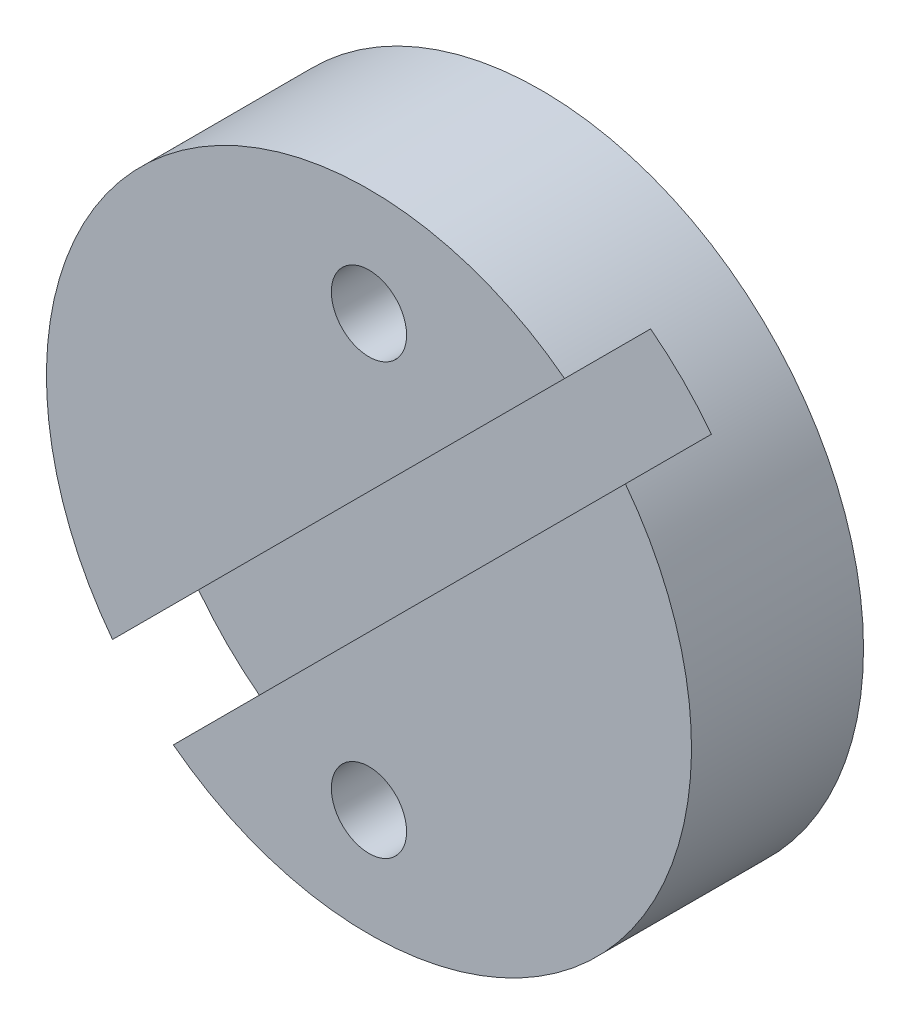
ISO-10303-21;
HEADER;
FILE_DESCRIPTION(('STEP AP214'),'2;1');
FILE_NAME('part.step','',(''),(''),'','','');
FILE_SCHEMA(('AUTOMOTIVE_DESIGN { 1 0 10303 214 1 1 1 1 }'));
ENDSEC;
DATA;
#1=APPLICATION_CONTEXT('core data for automotive mechanical design processes');
#2=APPLICATION_PROTOCOL_DEFINITION('international standard','automotive_design',2000,#1);
#3=PRODUCT_CONTEXT('',#1,'mechanical');
#4=PRODUCT('Part','Part','',(#3));
#5=PRODUCT_RELATED_PRODUCT_CATEGORY('part','',(#4));
#6=PRODUCT_DEFINITION_FORMATION('','',#4);
#7=PRODUCT_DEFINITION_CONTEXT('part definition',#1,'design');
#8=PRODUCT_DEFINITION('design','',#6,#7);
#9=PRODUCT_DEFINITION_SHAPE('','',#8);
#10=(LENGTH_UNIT() NAMED_UNIT(*) SI_UNIT(.MILLI.,.METRE.));
#11=(NAMED_UNIT(*) PLANE_ANGLE_UNIT() SI_UNIT($,.RADIAN.));
#12=(NAMED_UNIT(*) SI_UNIT($,.STERADIAN.) SOLID_ANGLE_UNIT());
#13=UNCERTAINTY_MEASURE_WITH_UNIT(LENGTH_MEASURE(1.E-05),#10,'distance_accuracy_value','');
#14=(GEOMETRIC_REPRESENTATION_CONTEXT(3) GLOBAL_UNCERTAINTY_ASSIGNED_CONTEXT((#13)) GLOBAL_UNIT_ASSIGNED_CONTEXT((#10,
#11,#12)) REPRESENTATION_CONTEXT('',''));
#15=CARTESIAN_POINT('',(0.,0.,0.));
#16=DIRECTION('',(0.,0.,1.));
#17=DIRECTION('',(1.,0.,0.));
#18=AXIS2_PLACEMENT_3D('',#15,#16,#17);
#19=CARTESIAN_POINT('',(0.,0.,8.));
#20=DIRECTION('',(0.,0.,1.));
#21=DIRECTION('',(1.,0.,0.));
#22=AXIS2_PLACEMENT_3D('',#19,#20,#21);
#23=PLANE('',#22);
#24=DIRECTION('',(-0.707106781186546,-0.707106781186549,0.));
#25=VECTOR('',#24,1.);
#26=CARTESIAN_POINT('',(-15.0086024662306,-12.1801753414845,8.));
#27=LINE('',#26,#25);
#28=CARTESIAN_POINT('',(9.0976844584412,11.9261115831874,8.));
#29=VERTEX_POINT('',#28);
#30=CARTESIAN_POINT('',(-11.9261115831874,-9.09768445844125,8.));
#31=VERTEX_POINT('',#30);
#32=EDGE_CURVE('E81',#29,#31,#27,.T.);
#33=ORIENTED_EDGE('',*,*,#32,.F.);
#34=CARTESIAN_POINT('',(0.,0.,8.));
#35=DIRECTION('',(0.,0.,1.));
#36=DIRECTION('',(1.,0.,0.));
#37=AXIS2_PLACEMENT_3D('',#34,#35,#36);
#38=CIRCLE('',#37,15.);
#39=EDGE_CURVE('E86',#29,#31,#38,.T.);
#40=ORIENTED_EDGE('',*,*,#39,.T.);
#41=EDGE_LOOP('',(#33,#40));
#42=FACE_BOUND('',#41,.T.);
#43=CARTESIAN_POINT('',(0.,10.,8.));
#44=DIRECTION('',(0.,0.,1.));
#45=DIRECTION('',(1.,0.,0.));
#46=AXIS2_PLACEMENT_3D('',#43,#44,#45);
#47=CIRCLE('',#46,1.75);
#48=CARTESIAN_POINT('',(1.75,10.,8.));
#49=VERTEX_POINT('',#48);
#50=EDGE_CURVE('E91',#49,#49,#47,.T.);
#51=ORIENTED_EDGE('',*,*,#50,.F.);
#52=EDGE_LOOP('',(#51));
#53=FACE_BOUND('',#52,.T.);
#54=ADVANCED_FACE('F26',(#42,#53),#23,.T.);
#55=DIRECTION('',(0.707106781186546,0.707106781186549,0.));
#56=VECTOR('',#55,1.);
#57=CARTESIAN_POINT('',(-12.1801753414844,-15.0086024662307,8.));
#58=LINE('',#57,#56);
#59=CARTESIAN_POINT('',(-9.0976844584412,-11.9261115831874,8.));
#60=VERTEX_POINT('',#59);
#61=CARTESIAN_POINT('',(11.9261115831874,9.09768445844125,8.));
#62=VERTEX_POINT('',#61);
#63=EDGE_CURVE('E68',#60,#62,#58,.T.);
#64=ORIENTED_EDGE('',*,*,#63,.F.);
#65=EDGE_CURVE('E80',#60,#62,#38,.T.);
#66=ORIENTED_EDGE('',*,*,#65,.T.);
#67=EDGE_LOOP('',(#64,#66));
#68=FACE_BOUND('',#67,.T.);
#69=CARTESIAN_POINT('',(0.,-10.,8.));
#70=DIRECTION('',(0.,0.,1.));
#71=DIRECTION('',(1.,0.,0.));
#72=AXIS2_PLACEMENT_3D('',#69,#70,#71);
#73=CIRCLE('',#72,1.75);
#74=CARTESIAN_POINT('',(1.75,-10.,8.));
#75=VERTEX_POINT('',#74);
#76=EDGE_CURVE('E111',#75,#75,#73,.T.);
#77=ORIENTED_EDGE('',*,*,#76,.F.);
#78=EDGE_LOOP('',(#77));
#79=FACE_BOUND('',#78,.T.);
#80=ADVANCED_FACE('F78',(#68,#79),#23,.T.);
#81=CARTESIAN_POINT('',(0.,0.,0.));
#82=DIRECTION('',(0.,0.,1.));
#83=DIRECTION('',(1.,0.,0.));
#84=AXIS2_PLACEMENT_3D('',#81,#82,#83);
#85=PLANE('',#84);
#86=CARTESIAN_POINT('',(0.,10.,0.));
#87=DIRECTION('',(0.,0.,1.));
#88=DIRECTION('',(1.,0.,0.));
#89=AXIS2_PLACEMENT_3D('',#86,#87,#88);
#90=CIRCLE('',#89,1.75);
#91=CARTESIAN_POINT('',(1.75,10.,0.));
#92=VERTEX_POINT('',#91);
#93=EDGE_CURVE('E114',#92,#92,#90,.T.);
#94=ORIENTED_EDGE('',*,*,#93,.T.);
#95=EDGE_LOOP('',(#94));
#96=FACE_BOUND('',#95,.T.);
#97=CARTESIAN_POINT('',(0.,0.,0.));
#98=DIRECTION('',(0.,0.,1.));
#99=DIRECTION('',(1.,0.,0.));
#100=AXIS2_PLACEMENT_3D('',#97,#98,#99);
#101=CIRCLE('',#100,15.);
#102=CARTESIAN_POINT('',(15.,0.,0.));
#103=VERTEX_POINT('',#102);
#104=EDGE_CURVE('E87',#103,#103,#101,.T.);
#105=ORIENTED_EDGE('',*,*,#104,.F.);
#106=EDGE_LOOP('',(#105));
#107=FACE_BOUND('',#106,.T.);
#108=CARTESIAN_POINT('',(0.,-10.,0.));
#109=DIRECTION('',(0.,0.,1.));
#110=DIRECTION('',(1.,0.,0.));
#111=AXIS2_PLACEMENT_3D('',#108,#109,#110);
#112=CIRCLE('',#111,1.75);
#113=CARTESIAN_POINT('',(1.75,-10.,0.));
#114=VERTEX_POINT('',#113);
#115=EDGE_CURVE('E102',#114,#114,#112,.T.);
#116=ORIENTED_EDGE('',*,*,#115,.T.);
#117=EDGE_LOOP('',(#116));
#118=FACE_BOUND('',#117,.T.);
#119=ADVANCED_FACE('F126',(#96,#107,#118),#85,.F.);
#120=CARTESIAN_POINT('',(0.,0.,8.));
#121=DIRECTION('',(0.,0.,-1.));
#122=DIRECTION('',(-1.,0.,0.));
#123=AXIS2_PLACEMENT_3D('',#120,#121,#122);
#124=CYLINDRICAL_SURFACE('',#123,15.);
#125=ORIENTED_EDGE('',*,*,#39,.F.);
#126=DIRECTION('',(0.,0.,-1.));
#127=VECTOR('',#126,1.);
#128=CARTESIAN_POINT('',(9.0976844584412,11.9261115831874,8.));
#129=LINE('',#128,#127);
#130=CARTESIAN_POINT('',(9.0976844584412,11.9261115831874,4.));
#131=VERTEX_POINT('',#130);
#132=EDGE_CURVE('E11',#29,#131,#129,.T.);
#133=ORIENTED_EDGE('',*,*,#132,.T.);
#134=CARTESIAN_POINT('',(0.,0.,4.));
#135=DIRECTION('',(0.,0.,1.));
#136=DIRECTION('',(1.,0.,0.));
#137=AXIS2_PLACEMENT_3D('',#134,#135,#136);
#138=CIRCLE('',#137,15.);
#139=CARTESIAN_POINT('',(11.9261115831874,9.09768445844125,4.));
#140=VERTEX_POINT('',#139);
#141=EDGE_CURVE('E95',#140,#131,#138,.T.);
#142=ORIENTED_EDGE('',*,*,#141,.F.);
#143=DIRECTION('',(0.,0.,-1.));
#144=VECTOR('',#143,1.);
#145=CARTESIAN_POINT('',(11.9261115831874,9.09768445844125,8.));
#146=LINE('',#145,#144);
#147=EDGE_CURVE('E34',#140,#62,#146,.F.);
#148=ORIENTED_EDGE('',*,*,#147,.T.);
#149=ORIENTED_EDGE('',*,*,#65,.F.);
#150=DIRECTION('',(0.,0.,-1.));
#151=VECTOR('',#150,1.);
#152=CARTESIAN_POINT('',(-9.0976844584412,-11.9261115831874,8.));
#153=LINE('',#152,#151);
#154=CARTESIAN_POINT('',(-9.0976844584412,-11.9261115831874,4.));
#155=VERTEX_POINT('',#154);
#156=EDGE_CURVE('E65',#60,#155,#153,.T.);
#157=ORIENTED_EDGE('',*,*,#156,.T.);
#158=CARTESIAN_POINT('',(-11.9261115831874,-9.09768445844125,4.));
#159=VERTEX_POINT('',#158);
#160=EDGE_CURVE('E74',#159,#155,#138,.T.);
#161=ORIENTED_EDGE('',*,*,#160,.F.);
#162=DIRECTION('',(0.,0.,-1.));
#163=VECTOR('',#162,1.);
#164=CARTESIAN_POINT('',(-11.9261115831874,-9.09768445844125,8.));
#165=LINE('',#164,#163);
#166=EDGE_CURVE('E73',#159,#31,#165,.F.);
#167=ORIENTED_EDGE('',*,*,#166,.T.);
#168=EDGE_LOOP('',(#125,#133,#142,#148,#149,#157,#161,#167));
#169=FACE_BOUND('',#168,.T.);
#170=ORIENTED_EDGE('',*,*,#104,.T.);
#171=EDGE_LOOP('',(#170));
#172=FACE_BOUND('',#171,.T.);
#173=ADVANCED_FACE('F28',(#169,#172),#124,.T.);
#174=CARTESIAN_POINT('',(0.,10.,8.));
#175=DIRECTION('',(0.,0.,-1.));
#176=DIRECTION('',(-1.,0.,0.));
#177=AXIS2_PLACEMENT_3D('',#174,#175,#176);
#178=CYLINDRICAL_SURFACE('',#177,1.75);
#179=ORIENTED_EDGE('',*,*,#50,.T.);
#180=EDGE_LOOP('',(#179));
#181=FACE_BOUND('',#180,.T.);
#182=ORIENTED_EDGE('',*,*,#93,.F.);
#183=EDGE_LOOP('',(#182));
#184=FACE_BOUND('',#183,.T.);
#185=ADVANCED_FACE('F119',(#181,#184),#178,.F.);
#186=CARTESIAN_POINT('',(0.,-10.,8.));
#187=DIRECTION('',(0.,0.,-1.));
#188=DIRECTION('',(-1.,0.,0.));
#189=AXIS2_PLACEMENT_3D('',#186,#187,#188);
#190=CYLINDRICAL_SURFACE('',#189,1.75);
#191=ORIENTED_EDGE('',*,*,#76,.T.);
#192=EDGE_LOOP('',(#191));
#193=FACE_BOUND('',#192,.T.);
#194=ORIENTED_EDGE('',*,*,#115,.F.);
#195=EDGE_LOOP('',(#194));
#196=FACE_BOUND('',#195,.T.);
#197=ADVANCED_FACE('F133',(#193,#196),#190,.F.);
#198=CARTESIAN_POINT('',(-15.0086024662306,-12.1801753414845,4.));
#199=DIRECTION('',(-0.707106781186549,0.707106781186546,0.));
#200=DIRECTION('',(-0.707106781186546,-0.707106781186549,0.));
#201=AXIS2_PLACEMENT_3D('',#198,#199,#200);
#202=PLANE('',#201);
#203=ORIENTED_EDGE('',*,*,#32,.T.);
#204=ORIENTED_EDGE('',*,*,#166,.F.);
#205=DIRECTION('',(-0.707106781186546,-0.707106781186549,0.));
#206=VECTOR('',#205,1.);
#207=CARTESIAN_POINT('',(-15.0086024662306,-12.1801753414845,4.));
#208=LINE('',#207,#206);
#209=EDGE_CURVE('E41',#131,#159,#208,.T.);
#210=ORIENTED_EDGE('',*,*,#209,.F.);
#211=ORIENTED_EDGE('',*,*,#132,.F.);
#212=EDGE_LOOP('',(#203,#204,#210,#211));
#213=FACE_BOUND('',#212,.T.);
#214=ADVANCED_FACE('F100',(#213),#202,.F.);
#215=CARTESIAN_POINT('',(-12.1801753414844,-15.0086024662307,4.));
#216=DIRECTION('',(0.707106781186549,-0.707106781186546,0.));
#217=DIRECTION('',(0.707106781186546,0.707106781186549,0.));
#218=AXIS2_PLACEMENT_3D('',#215,#216,#217);
#219=PLANE('',#218);
#220=ORIENTED_EDGE('',*,*,#63,.T.);
#221=ORIENTED_EDGE('',*,*,#147,.F.);
#222=DIRECTION('',(0.707106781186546,0.707106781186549,0.));
#223=VECTOR('',#222,1.);
#224=CARTESIAN_POINT('',(-12.1801753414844,-15.0086024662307,4.));
#225=LINE('',#224,#223);
#226=EDGE_CURVE('E69',#155,#140,#225,.T.);
#227=ORIENTED_EDGE('',*,*,#226,.F.);
#228=ORIENTED_EDGE('',*,*,#156,.F.);
#229=EDGE_LOOP('',(#220,#221,#227,#228));
#230=FACE_BOUND('',#229,.T.);
#231=ADVANCED_FACE('F67',(#230),#219,.F.);
#232=CARTESIAN_POINT('',(-12.1801753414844,-15.0086024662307,4.));
#233=DIRECTION('',(0.,0.,1.));
#234=DIRECTION('',(1.,0.,0.));
#235=AXIS2_PLACEMENT_3D('',#232,#233,#234);
#236=PLANE('',#235);
#237=ORIENTED_EDGE('',*,*,#141,.T.);
#238=ORIENTED_EDGE('',*,*,#209,.T.);
#239=ORIENTED_EDGE('',*,*,#160,.T.);
#240=ORIENTED_EDGE('',*,*,#226,.T.);
#241=EDGE_LOOP('',(#237,#238,#239,#240));
#242=FACE_BOUND('',#241,.T.);
#243=ADVANCED_FACE('F98',(#242),#236,.T.);
#244=CLOSED_SHELL('',(#54,#80,#119,#173,#185,#197,#214,#231,#243));
#245=MANIFOLD_SOLID_BREP('B2',#244);
#246=ADVANCED_BREP_SHAPE_REPRESENTATION('',(#18,#245),#14);
#247=SHAPE_DEFINITION_REPRESENTATION(#9,#246);
ENDSEC;
END-ISO-10303-21;
